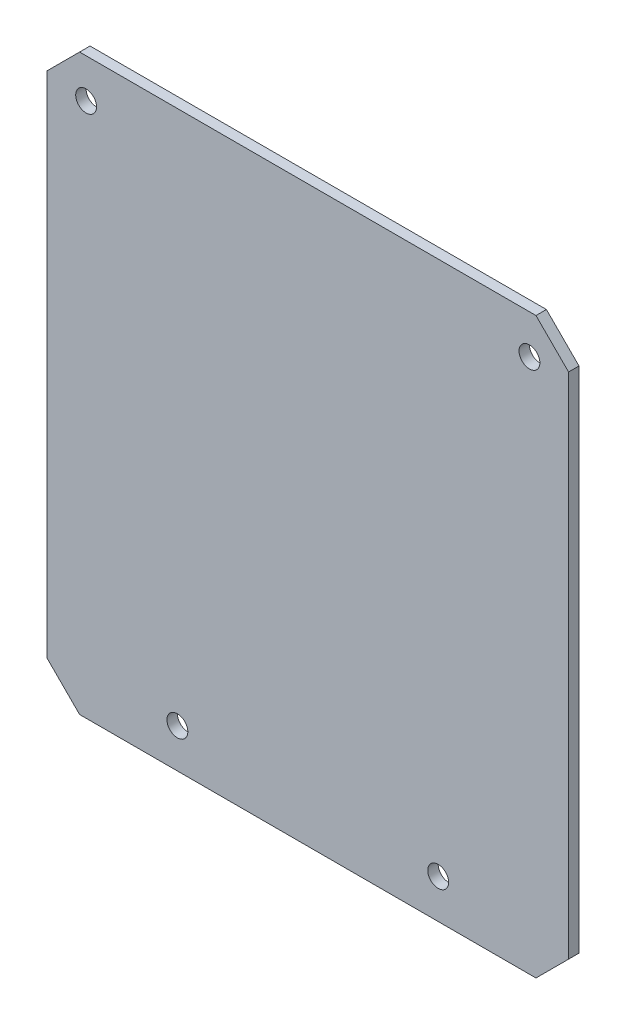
from build123d import *

# Parameters (mm, degrees)
SKETCH_1_R                      = 1.6
REFERENCE_PCB_ASSUMED_1P6_DEPTH = 1.6


with BuildPart() as part:
    # Sketch 1 → Reference_PCB_assumed_1p6 (new body)
    with BuildSketch(Plane.XY):
        Polygon((-33.5, -49.5), (36.5, -49.5), (41.5, -44.5), (41.5, 33.5), (36.5, 38.5), (-33.5, 38.5), (-38.5, 33.5), (-38.5, -44.5), align=None)
        with Locations((-32.5, 32.5)):
            Circle(SKETCH_1_R, mode=Mode.SUBTRACT)
        with Locations((35.5, 32.5)):
            Circle(SKETCH_1_R, mode=Mode.SUBTRACT)
        with Locations((-18.5, -43.5)):
            Circle(SKETCH_1_R, mode=Mode.SUBTRACT)
        with Locations((21.5, -43.5)):
            Circle(SKETCH_1_R, mode=Mode.SUBTRACT)
    extrude(amount=REFERENCE_PCB_ASSUMED_1P6_DEPTH)


solid = part.part
